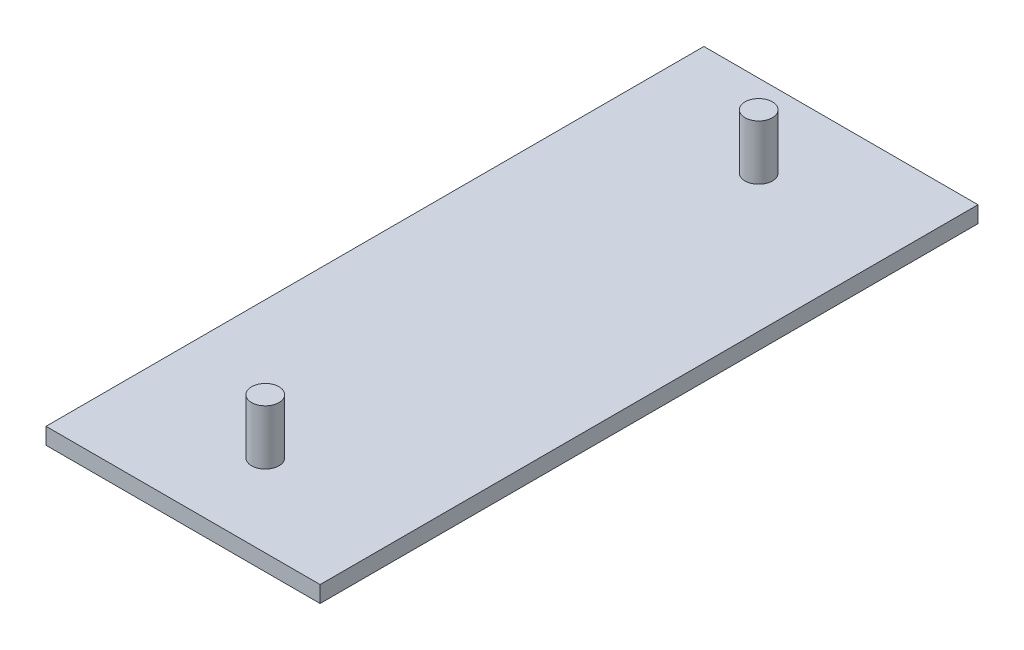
ISO-10303-21;
HEADER;
FILE_DESCRIPTION(('STEP AP214'),'2;1');
FILE_NAME('part.step','',(''),(''),'','','');
FILE_SCHEMA(('AUTOMOTIVE_DESIGN { 1 0 10303 214 1 1 1 1 }'));
ENDSEC;
DATA;
#1=APPLICATION_CONTEXT('core data for automotive mechanical design processes');
#2=APPLICATION_PROTOCOL_DEFINITION('international standard','automotive_design',2000,#1);
#3=PRODUCT_CONTEXT('',#1,'mechanical');
#4=PRODUCT('Part','Part','',(#3));
#5=PRODUCT_RELATED_PRODUCT_CATEGORY('part','',(#4));
#6=PRODUCT_DEFINITION_FORMATION('','',#4);
#7=PRODUCT_DEFINITION_CONTEXT('part definition',#1,'design');
#8=PRODUCT_DEFINITION('design','',#6,#7);
#9=PRODUCT_DEFINITION_SHAPE('','',#8);
#10=(LENGTH_UNIT() NAMED_UNIT(*) SI_UNIT(.MILLI.,.METRE.));
#11=(NAMED_UNIT(*) PLANE_ANGLE_UNIT() SI_UNIT($,.RADIAN.));
#12=(NAMED_UNIT(*) SI_UNIT($,.STERADIAN.) SOLID_ANGLE_UNIT());
#13=UNCERTAINTY_MEASURE_WITH_UNIT(LENGTH_MEASURE(1.E-05),#10,'distance_accuracy_value','');
#14=(GEOMETRIC_REPRESENTATION_CONTEXT(3) GLOBAL_UNCERTAINTY_ASSIGNED_CONTEXT((#13)) GLOBAL_UNIT_ASSIGNED_CONTEXT((#10,
#11,#12)) REPRESENTATION_CONTEXT('',''));
#15=CARTESIAN_POINT('',(0.,0.,0.));
#16=DIRECTION('',(0.,0.,1.));
#17=DIRECTION('',(1.,0.,0.));
#18=AXIS2_PLACEMENT_3D('',#15,#16,#17);
#19=CARTESIAN_POINT('',(25.,3.,60.));
#20=DIRECTION('',(0.,1.,0.));
#21=DIRECTION('',(0.,0.,1.));
#22=AXIS2_PLACEMENT_3D('',#19,#20,#21);
#23=PLANE('',#22);
#24=CARTESIAN_POINT('',(0.,3.,-45.));
#25=DIRECTION('',(0.,1.,0.));
#26=DIRECTION('',(0.,0.,1.));
#27=AXIS2_PLACEMENT_3D('',#24,#25,#26);
#28=CIRCLE('',#27,2.5);
#29=CARTESIAN_POINT('',(0.,3.,-42.5));
#30=VERTEX_POINT('',#29);
#31=EDGE_CURVE('E115',#30,#30,#28,.T.);
#32=ORIENTED_EDGE('',*,*,#31,.F.);
#33=EDGE_LOOP('',(#32));
#34=FACE_BOUND('',#33,.T.);
#35=DIRECTION('',(0.,0.,-1.));
#36=VECTOR('',#35,1.);
#37=CARTESIAN_POINT('',(25.,3.,-60.));
#38=LINE('',#37,#36);
#39=CARTESIAN_POINT('',(25.,3.,60.));
#40=VERTEX_POINT('',#39);
#41=CARTESIAN_POINT('',(25.,3.,-60.));
#42=VERTEX_POINT('',#41);
#43=EDGE_CURVE('E89',#40,#42,#38,.T.);
#44=ORIENTED_EDGE('',*,*,#43,.T.);
#45=DIRECTION('',(-1.,0.,0.));
#46=VECTOR('',#45,1.);
#47=CARTESIAN_POINT('',(-25.,3.,-60.));
#48=LINE('',#47,#46);
#49=CARTESIAN_POINT('',(-25.,3.,-60.));
#50=VERTEX_POINT('',#49);
#51=EDGE_CURVE('E84',#42,#50,#48,.T.);
#52=ORIENTED_EDGE('',*,*,#51,.T.);
#53=DIRECTION('',(0.,0.,1.));
#54=VECTOR('',#53,1.);
#55=CARTESIAN_POINT('',(-25.,3.,-60.));
#56=LINE('',#55,#54);
#57=CARTESIAN_POINT('',(-25.,3.,60.));
#58=VERTEX_POINT('',#57);
#59=EDGE_CURVE('E87',#50,#58,#56,.T.);
#60=ORIENTED_EDGE('',*,*,#59,.T.);
#61=DIRECTION('',(1.,0.,0.));
#62=VECTOR('',#61,1.);
#63=CARTESIAN_POINT('',(-25.,3.,60.));
#64=LINE('',#63,#62);
#65=EDGE_CURVE('E54',#58,#40,#64,.T.);
#66=ORIENTED_EDGE('',*,*,#65,.T.);
#67=EDGE_LOOP('',(#44,#52,#60,#66));
#68=FACE_BOUND('',#67,.T.);
#69=CARTESIAN_POINT('',(0.,3.,45.));
#70=DIRECTION('',(0.,1.,0.));
#71=DIRECTION('',(0.,0.,1.));
#72=AXIS2_PLACEMENT_3D('',#69,#70,#71);
#73=CIRCLE('',#72,2.5);
#74=CARTESIAN_POINT('',(0.,3.,47.5));
#75=VERTEX_POINT('',#74);
#76=EDGE_CURVE('E121',#75,#75,#73,.T.);
#77=ORIENTED_EDGE('',*,*,#76,.F.);
#78=EDGE_LOOP('',(#77));
#79=FACE_BOUND('',#78,.T.);
#80=ADVANCED_FACE('F37',(#34,#68,#79),#23,.T.);
#81=CARTESIAN_POINT('',(25.,3.,-60.));
#82=DIRECTION('',(-1.,0.,0.));
#83=DIRECTION('',(0.,0.,1.));
#84=AXIS2_PLACEMENT_3D('',#81,#82,#83);
#85=PLANE('',#84);
#86=DIRECTION('',(0.,0.,-1.));
#87=VECTOR('',#86,1.);
#88=CARTESIAN_POINT('',(25.,0.,-60.));
#89=LINE('',#88,#87);
#90=CARTESIAN_POINT('',(25.,0.,60.));
#91=VERTEX_POINT('',#90);
#92=CARTESIAN_POINT('',(25.,0.,-60.));
#93=VERTEX_POINT('',#92);
#94=EDGE_CURVE('E101',#91,#93,#89,.T.);
#95=ORIENTED_EDGE('',*,*,#94,.T.);
#96=DIRECTION('',(0.,-1.,0.));
#97=VECTOR('',#96,1.);
#98=CARTESIAN_POINT('',(25.,3.,-60.));
#99=LINE('',#98,#97);
#100=EDGE_CURVE('E11',#42,#93,#99,.T.);
#101=ORIENTED_EDGE('',*,*,#100,.F.);
#102=ORIENTED_EDGE('',*,*,#43,.F.);
#103=DIRECTION('',(0.,-1.,0.));
#104=VECTOR('',#103,1.);
#105=CARTESIAN_POINT('',(25.,3.,60.));
#106=LINE('',#105,#104);
#107=EDGE_CURVE('E97',#40,#91,#106,.T.);
#108=ORIENTED_EDGE('',*,*,#107,.T.);
#109=EDGE_LOOP('',(#95,#101,#102,#108));
#110=FACE_BOUND('',#109,.T.);
#111=ADVANCED_FACE('F39',(#110),#85,.F.);
#112=CARTESIAN_POINT('',(-25.,3.,-60.));
#113=DIRECTION('',(0.,0.,1.));
#114=DIRECTION('',(1.,0.,0.));
#115=AXIS2_PLACEMENT_3D('',#112,#113,#114);
#116=PLANE('',#115);
#117=DIRECTION('',(-1.,0.,0.));
#118=VECTOR('',#117,1.);
#119=CARTESIAN_POINT('',(-25.,0.,-60.));
#120=LINE('',#119,#118);
#121=CARTESIAN_POINT('',(-25.,0.,-60.));
#122=VERTEX_POINT('',#121);
#123=EDGE_CURVE('E93',#93,#122,#120,.T.);
#124=ORIENTED_EDGE('',*,*,#123,.T.);
#125=DIRECTION('',(0.,-1.,0.));
#126=VECTOR('',#125,1.);
#127=CARTESIAN_POINT('',(-25.,3.,-60.));
#128=LINE('',#127,#126);
#129=EDGE_CURVE('E46',#50,#122,#128,.T.);
#130=ORIENTED_EDGE('',*,*,#129,.F.);
#131=ORIENTED_EDGE('',*,*,#51,.F.);
#132=ORIENTED_EDGE('',*,*,#100,.T.);
#133=EDGE_LOOP('',(#124,#130,#131,#132));
#134=FACE_BOUND('',#133,.T.);
#135=ADVANCED_FACE('F92',(#134),#116,.F.);
#136=CARTESIAN_POINT('',(-25.,3.,-60.));
#137=DIRECTION('',(1.,0.,0.));
#138=DIRECTION('',(0.,0.,-1.));
#139=AXIS2_PLACEMENT_3D('',#136,#137,#138);
#140=PLANE('',#139);
#141=DIRECTION('',(0.,0.,1.));
#142=VECTOR('',#141,1.);
#143=CARTESIAN_POINT('',(-25.,0.,-60.));
#144=LINE('',#143,#142);
#145=CARTESIAN_POINT('',(-25.,0.,60.));
#146=VERTEX_POINT('',#145);
#147=EDGE_CURVE('E71',#122,#146,#144,.T.);
#148=ORIENTED_EDGE('',*,*,#147,.T.);
#149=DIRECTION('',(0.,-1.,0.));
#150=VECTOR('',#149,1.);
#151=CARTESIAN_POINT('',(-25.,3.,60.));
#152=LINE('',#151,#150);
#153=EDGE_CURVE('E94',#58,#146,#152,.T.);
#154=ORIENTED_EDGE('',*,*,#153,.F.);
#155=ORIENTED_EDGE('',*,*,#59,.F.);
#156=ORIENTED_EDGE('',*,*,#129,.T.);
#157=EDGE_LOOP('',(#148,#154,#155,#156));
#158=FACE_BOUND('',#157,.T.);
#159=ADVANCED_FACE('F95',(#158),#140,.F.);
#160=CARTESIAN_POINT('',(-25.,3.,60.));
#161=DIRECTION('',(0.,0.,-1.));
#162=DIRECTION('',(-1.,0.,0.));
#163=AXIS2_PLACEMENT_3D('',#160,#161,#162);
#164=PLANE('',#163);
#165=DIRECTION('',(1.,0.,0.));
#166=VECTOR('',#165,1.);
#167=CARTESIAN_POINT('',(-25.,0.,60.));
#168=LINE('',#167,#166);
#169=EDGE_CURVE('E77',#146,#91,#168,.T.);
#170=ORIENTED_EDGE('',*,*,#169,.T.);
#171=ORIENTED_EDGE('',*,*,#107,.F.);
#172=ORIENTED_EDGE('',*,*,#65,.F.);
#173=ORIENTED_EDGE('',*,*,#153,.T.);
#174=EDGE_LOOP('',(#170,#171,#172,#173));
#175=FACE_BOUND('',#174,.T.);
#176=ADVANCED_FACE('F109',(#175),#164,.F.);
#177=CARTESIAN_POINT('',(25.,0.,60.));
#178=DIRECTION('',(0.,1.,0.));
#179=DIRECTION('',(0.,0.,1.));
#180=AXIS2_PLACEMENT_3D('',#177,#178,#179);
#181=PLANE('',#180);
#182=ORIENTED_EDGE('',*,*,#94,.F.);
#183=ORIENTED_EDGE('',*,*,#169,.F.);
#184=ORIENTED_EDGE('',*,*,#147,.F.);
#185=ORIENTED_EDGE('',*,*,#123,.F.);
#186=EDGE_LOOP('',(#182,#183,#184,#185));
#187=FACE_BOUND('',#186,.T.);
#188=ADVANCED_FACE('F112',(#187),#181,.F.);
#189=CARTESIAN_POINT('',(0.,13.,-45.));
#190=DIRECTION('',(0.,-1.,0.));
#191=DIRECTION('',(0.,0.,-1.));
#192=AXIS2_PLACEMENT_3D('',#189,#190,#191);
#193=CYLINDRICAL_SURFACE('',#192,2.5);
#194=CARTESIAN_POINT('',(0.,13.,-45.));
#195=DIRECTION('',(0.,1.,0.));
#196=DIRECTION('',(0.,0.,1.));
#197=AXIS2_PLACEMENT_3D('',#194,#195,#196);
#198=CIRCLE('',#197,2.5);
#199=CARTESIAN_POINT('',(0.,13.,-42.5));
#200=VERTEX_POINT('',#199);
#201=EDGE_CURVE('E104',#200,#200,#198,.T.);
#202=ORIENTED_EDGE('',*,*,#201,.F.);
#203=EDGE_LOOP('',(#202));
#204=FACE_BOUND('',#203,.T.);
#205=ORIENTED_EDGE('',*,*,#31,.T.);
#206=EDGE_LOOP('',(#205));
#207=FACE_BOUND('',#206,.T.);
#208=ADVANCED_FACE('F144',(#204,#207),#193,.T.);
#209=CARTESIAN_POINT('',(0.,13.,-45.));
#210=DIRECTION('',(0.,1.,0.));
#211=DIRECTION('',(0.,0.,1.));
#212=AXIS2_PLACEMENT_3D('',#209,#210,#211);
#213=PLANE('',#212);
#214=ORIENTED_EDGE('',*,*,#201,.T.);
#215=EDGE_LOOP('',(#214));
#216=FACE_BOUND('',#215,.T.);
#217=ADVANCED_FACE('F132',(#216),#213,.T.);
#218=CARTESIAN_POINT('',(0.,13.,45.));
#219=DIRECTION('',(0.,-1.,0.));
#220=DIRECTION('',(0.,0.,-1.));
#221=AXIS2_PLACEMENT_3D('',#218,#219,#220);
#222=CYLINDRICAL_SURFACE('',#221,2.5);
#223=CARTESIAN_POINT('',(0.,13.,45.));
#224=DIRECTION('',(0.,1.,0.));
#225=DIRECTION('',(0.,0.,1.));
#226=AXIS2_PLACEMENT_3D('',#223,#224,#225);
#227=CIRCLE('',#226,2.5);
#228=CARTESIAN_POINT('',(0.,13.,47.5));
#229=VERTEX_POINT('',#228);
#230=EDGE_CURVE('E118',#229,#229,#227,.T.);
#231=ORIENTED_EDGE('',*,*,#230,.F.);
#232=EDGE_LOOP('',(#231));
#233=FACE_BOUND('',#232,.T.);
#234=ORIENTED_EDGE('',*,*,#76,.T.);
#235=EDGE_LOOP('',(#234));
#236=FACE_BOUND('',#235,.T.);
#237=ADVANCED_FACE('F129',(#233,#236),#222,.T.);
#238=CARTESIAN_POINT('',(0.,13.,45.));
#239=DIRECTION('',(0.,1.,0.));
#240=DIRECTION('',(0.,0.,1.));
#241=AXIS2_PLACEMENT_3D('',#238,#239,#240);
#242=PLANE('',#241);
#243=ORIENTED_EDGE('',*,*,#230,.T.);
#244=EDGE_LOOP('',(#243));
#245=FACE_BOUND('',#244,.T.);
#246=ADVANCED_FACE('F127',(#245),#242,.T.);
#247=CLOSED_SHELL('',(#80,#111,#135,#159,#176,#188,#208,#217,#237,#246));
#248=MANIFOLD_SOLID_BREP('B2',#247);
#249=ADVANCED_BREP_SHAPE_REPRESENTATION('',(#18,#248),#14);
#250=SHAPE_DEFINITION_REPRESENTATION(#9,#249);
ENDSEC;
END-ISO-10303-21;
